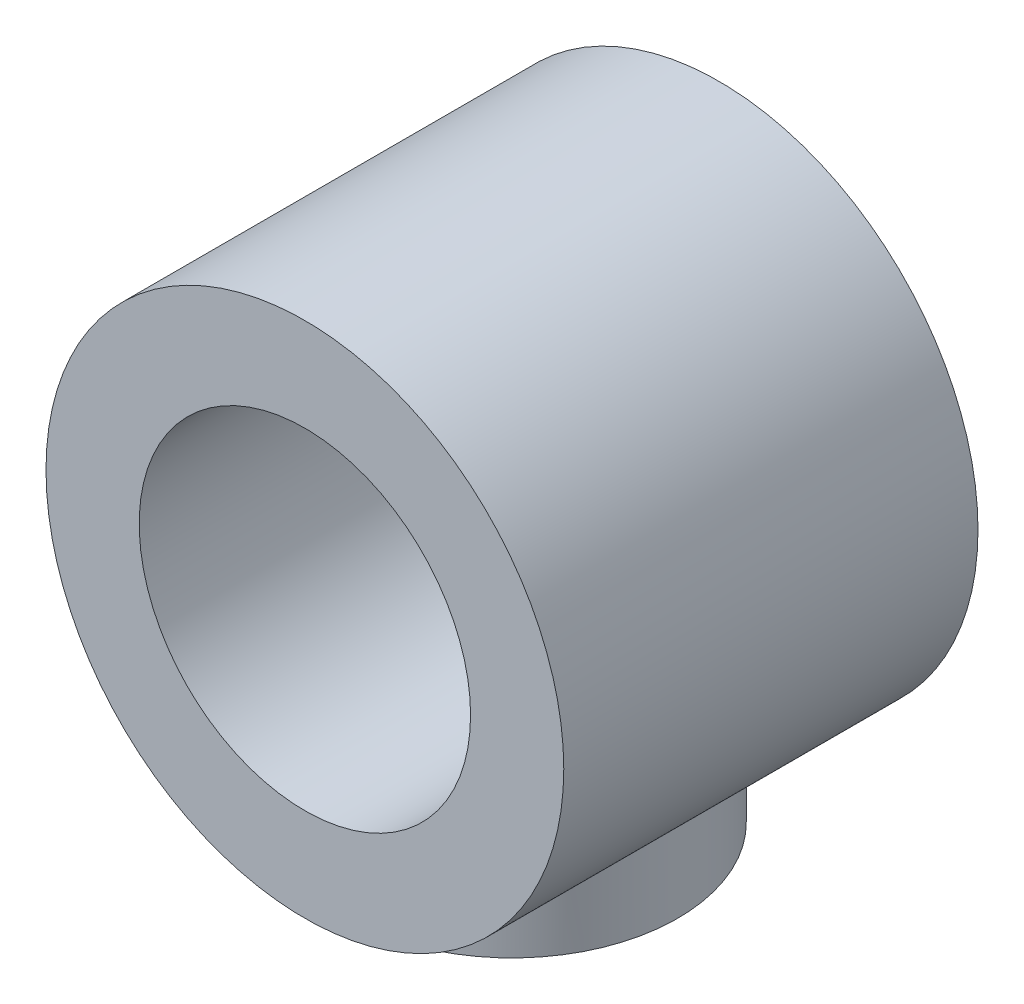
ISO-10303-21;
HEADER;
FILE_DESCRIPTION(('STEP AP214'),'2;1');
FILE_NAME('part.step','',(''),(''),'','','');
FILE_SCHEMA(('AUTOMOTIVE_DESIGN { 1 0 10303 214 1 1 1 1 }'));
ENDSEC;
DATA;
#1=APPLICATION_CONTEXT('core data for automotive mechanical design processes');
#2=APPLICATION_PROTOCOL_DEFINITION('international standard','automotive_design',2000,#1);
#3=PRODUCT_CONTEXT('',#1,'mechanical');
#4=PRODUCT('Part','Part','',(#3));
#5=PRODUCT_RELATED_PRODUCT_CATEGORY('part','',(#4));
#6=PRODUCT_DEFINITION_FORMATION('','',#4);
#7=PRODUCT_DEFINITION_CONTEXT('part definition',#1,'design');
#8=PRODUCT_DEFINITION('design','',#6,#7);
#9=PRODUCT_DEFINITION_SHAPE('','',#8);
#10=(LENGTH_UNIT() NAMED_UNIT(*) SI_UNIT(.MILLI.,.METRE.));
#11=(NAMED_UNIT(*) PLANE_ANGLE_UNIT() SI_UNIT($,.RADIAN.));
#12=(NAMED_UNIT(*) SI_UNIT($,.STERADIAN.) SOLID_ANGLE_UNIT());
#13=UNCERTAINTY_MEASURE_WITH_UNIT(LENGTH_MEASURE(1.E-05),#10,'distance_accuracy_value','');
#14=(GEOMETRIC_REPRESENTATION_CONTEXT(3) GLOBAL_UNCERTAINTY_ASSIGNED_CONTEXT((#13)) GLOBAL_UNIT_ASSIGNED_CONTEXT((#10,
#11,#12)) REPRESENTATION_CONTEXT('',''));
#15=CARTESIAN_POINT('',(0.,0.,0.));
#16=DIRECTION('',(0.,0.,1.));
#17=DIRECTION('',(1.,0.,0.));
#18=AXIS2_PLACEMENT_3D('',#15,#16,#17);
#19=CARTESIAN_POINT('',(0.,-77.5,50.));
#20=DIRECTION('',(0.,1.,0.));
#21=DIRECTION('',(0.,0.,1.));
#22=AXIS2_PLACEMENT_3D('',#19,#20,#21);
#23=CYLINDRICAL_SURFACE('',#22,20.);
#24=CARTESIAN_POINT('',(0.,-72.5,50.));
#25=DIRECTION('',(0.,1.,0.));
#26=DIRECTION('',(0.,0.,1.));
#27=AXIS2_PLACEMENT_3D('',#24,#25,#26);
#28=CIRCLE('',#27,20.);
#29=CARTESIAN_POINT('',(0.,-72.5,70.));
#30=VERTEX_POINT('',#29);
#31=EDGE_CURVE('E19',#30,#30,#28,.T.);
#32=ORIENTED_EDGE('',*,*,#31,.T.);
#33=EDGE_LOOP('',(#32));
#34=FACE_BOUND('',#33,.T.);
#35=CARTESIAN_POINT('',(0.,-67.5,50.));
#36=DIRECTION('',(0.,1.,0.));
#37=DIRECTION('',(0.,0.,1.));
#38=AXIS2_PLACEMENT_3D('',#35,#36,#37);
#39=CIRCLE('',#38,20.);
#40=CARTESIAN_POINT('',(0.,-67.5,70.));
#41=VERTEX_POINT('',#40);
#42=EDGE_CURVE('E71',#41,#41,#39,.F.);
#43=ORIENTED_EDGE('',*,*,#42,.T.);
#44=EDGE_LOOP('',(#43));
#45=FACE_BOUND('',#44,.T.);
#46=ADVANCED_FACE('F14',(#34,#45),#23,.T.);
#47=CARTESIAN_POINT('',(0.,-72.5,50.));
#48=DIRECTION('',(0.,1.,0.));
#49=DIRECTION('',(0.,0.,1.));
#50=AXIS2_PLACEMENT_3D('',#47,#48,#49);
#51=PLANE('',#50);
#52=CARTESIAN_POINT('',(0.,-72.5,50.));
#53=DIRECTION('',(0.,1.,0.));
#54=DIRECTION('',(-1.,0.,0.));
#55=AXIS2_PLACEMENT_3D('',#52,#53,#54);
#56=CIRCLE('',#55,5.053);
#57=CARTESIAN_POINT('',(-5.053,-72.5,50.));
#58=VERTEX_POINT('',#57);
#59=EDGE_CURVE('E69',#58,#58,#56,.T.);
#60=ORIENTED_EDGE('',*,*,#59,.T.);
#61=EDGE_LOOP('',(#60));
#62=FACE_BOUND('',#61,.T.);
#63=ORIENTED_EDGE('',*,*,#31,.F.);
#64=EDGE_LOOP('',(#63));
#65=FACE_BOUND('',#64,.T.);
#66=ADVANCED_FACE('F79',(#62,#65),#51,.F.);
#67=CARTESIAN_POINT('',(0.,-67.5,50.));
#68=DIRECTION('',(0.,1.,0.));
#69=DIRECTION('',(0.,0.,1.));
#70=AXIS2_PLACEMENT_3D('',#67,#68,#69);
#71=PLANE('',#70);
#72=ORIENTED_EDGE('',*,*,#42,.F.);
#73=EDGE_LOOP('',(#72));
#74=FACE_BOUND('',#73,.T.);
#75=CARTESIAN_POINT('',(0.,-67.5,50.));
#76=DIRECTION('',(0.,1.,0.));
#77=DIRECTION('',(0.,0.,1.));
#78=AXIS2_PLACEMENT_3D('',#75,#76,#77);
#79=CIRCLE('',#78,40.);
#80=CARTESIAN_POINT('',(0.,-67.5,90.));
#81=VERTEX_POINT('',#80);
#82=EDGE_CURVE('E66',#81,#81,#79,.T.);
#83=ORIENTED_EDGE('',*,*,#82,.F.);
#84=EDGE_LOOP('',(#83));
#85=FACE_BOUND('',#84,.T.);
#86=ADVANCED_FACE('F81',(#74,#85),#71,.F.);
#87=CARTESIAN_POINT('',(0.,-72.5,50.));
#88=DIRECTION('',(0.,1.,0.));
#89=DIRECTION('',(-1.,0.,0.));
#90=AXIS2_PLACEMENT_3D('',#87,#88,#89);
#91=CYLINDRICAL_SURFACE('',#90,5.053);
#92=ORIENTED_EDGE('',*,*,#59,.F.);
#93=EDGE_LOOP('',(#92));
#94=FACE_BOUND('',#93,.T.);
#95=CARTESIAN_POINT('',(-5.05300000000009,-39.6795563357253,50.));
#96=CARTESIAN_POINT('',(-5.05299925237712,-39.679556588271,50.1412373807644));
#97=CARTESIAN_POINT('',(-5.04707338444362,-39.6803124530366,50.2824970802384));
#98=CARTESIAN_POINT('',(-5.02340684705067,-39.6833154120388,50.5640629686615));
#99=CARTESIAN_POINT('',(-5.00566054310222,-39.6855632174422,50.7043686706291));
#100=CARTESIAN_POINT('',(-4.95844181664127,-39.6914905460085,50.983203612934));
#101=CARTESIAN_POINT('',(-4.92895007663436,-39.6951724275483,51.1217295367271));
#102=CARTESIAN_POINT('',(-4.85844639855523,-39.7038632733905,51.3958300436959));
#103=CARTESIAN_POINT('',(-4.81743010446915,-39.7088727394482,51.5314034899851));
#104=CARTESIAN_POINT('',(-4.72425217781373,-39.7200659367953,51.7983915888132));
#105=CARTESIAN_POINT('',(-4.67210690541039,-39.7262479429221,51.9298120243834));
#106=CARTESIAN_POINT('',(-4.5569924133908,-39.7396172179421,52.1878282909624));
#107=CARTESIAN_POINT('',(-4.49401920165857,-39.7468048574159,52.3144223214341));
#108=CARTESIAN_POINT('',(-4.35776718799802,-39.7619737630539,52.5617558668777));
#109=CARTESIAN_POINT('',(-4.28449657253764,-39.7699543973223,52.6824999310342));
#110=CARTESIAN_POINT('',(-4.12810079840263,-39.7864922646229,52.917450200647));
#111=CARTESIAN_POINT('',(-4.04497199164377,-39.7950497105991,53.0316539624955));
#112=CARTESIAN_POINT('',(-3.86903798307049,-39.812540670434,53.253223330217));
#113=CARTESIAN_POINT('',(-3.77618794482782,-39.8214758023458,53.3605532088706));
#114=CARTESIAN_POINT('',(-3.58176047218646,-39.8394342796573,53.567060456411));
#115=CARTESIAN_POINT('',(-3.48017982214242,-39.8484576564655,53.6662347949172));
#116=CARTESIAN_POINT('',(-3.26905664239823,-39.8663327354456,53.8556694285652));
#117=CARTESIAN_POINT('',(-3.1595162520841,-39.8751844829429,53.9459321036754));
#118=CARTESIAN_POINT('',(-2.9331696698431,-39.8924729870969,54.1169714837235));
#119=CARTESIAN_POINT('',(-2.81636081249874,-39.9009095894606,54.1977446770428));
#120=CARTESIAN_POINT('',(-2.57596637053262,-39.9171510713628,54.3494211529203));
#121=CARTESIAN_POINT('',(-2.45236151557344,-39.9249539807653,54.420294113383));
#122=CARTESIAN_POINT('',(-2.19952328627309,-39.9396812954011,54.5513949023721));
#123=CARTESIAN_POINT('',(-2.07028783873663,-39.9466053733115,54.6116187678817));
#124=CARTESIAN_POINT('',(-1.8071890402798,-39.9593717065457,54.7209269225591));
#125=CARTESIAN_POINT('',(-1.67332761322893,-39.9652144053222,54.770015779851));
#126=CARTESIAN_POINT('',(-1.40187784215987,-39.9756581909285,54.8567358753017));
#127=CARTESIAN_POINT('',(-1.26428813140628,-39.9802588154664,54.894362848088));
#128=CARTESIAN_POINT('',(-0.849010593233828,-39.9919392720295,54.9892035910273));
#129=CARTESIAN_POINT('',(-0.567100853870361,-39.9969833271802,55.0290864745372));
#130=CARTESIAN_POINT('',(-0.000550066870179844,-40.0010027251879,55.0609585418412));
#131=CARTESIAN_POINT('',(0.284090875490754,-39.9999783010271,55.0529495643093));
#132=CARTESIAN_POINT('',(0.705919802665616,-39.9940185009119,55.005442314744));
#133=CARTESIAN_POINT('',(0.845354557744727,-39.991306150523,54.9837825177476));
#134=CARTESIAN_POINT('',(1.12187663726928,-39.9845027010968,54.9288981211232));
#135=CARTESIAN_POINT('',(1.25896481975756,-39.9804121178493,54.8956778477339));
#136=CARTESIAN_POINT('',(1.52988812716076,-39.9709624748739,54.8178969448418));
#137=CARTESIAN_POINT('',(1.66372196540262,-39.9656029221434,54.7733319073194));
#138=CARTESIAN_POINT('',(1.92710882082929,-39.9537685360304,54.6732108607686));
#139=CARTESIAN_POINT('',(2.05666336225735,-39.9472941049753,54.6176588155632));
#140=CARTESIAN_POINT('',(2.31103830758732,-39.9333868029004,54.4957608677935));
#141=CARTESIAN_POINT('',(2.43584256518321,-39.9259509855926,54.4293816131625));
#142=CARTESIAN_POINT('',(2.67937561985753,-39.910347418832,54.2864533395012));
#143=CARTESIAN_POINT('',(2.79810659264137,-39.9021799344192,54.2099079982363));
#144=CARTESIAN_POINT('',(3.02875915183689,-39.8853356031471,54.0471418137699));
#145=CARTESIAN_POINT('',(3.14067852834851,-39.8766585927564,53.9609178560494));
#146=CARTESIAN_POINT('',(3.35685594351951,-39.8590426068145,53.7794491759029));
#147=CARTESIAN_POINT('',(3.46111673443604,-39.8501037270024,53.6842077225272));
#148=CARTESIAN_POINT('',(3.6620220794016,-39.8321458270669,53.4846227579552));
#149=CARTESIAN_POINT('',(3.75860666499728,-39.823126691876,53.3802188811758));
#150=CARTESIAN_POINT('',(3.94260987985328,-39.8053309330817,53.1636713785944));
#151=CARTESIAN_POINT('',(4.03003184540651,-39.7965542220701,53.0515305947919));
#152=CARTESIAN_POINT('',(4.19520212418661,-39.7794819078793,52.8201609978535));
#153=CARTESIAN_POINT('',(4.27294232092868,-39.7711867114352,52.700926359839));
#154=CARTESIAN_POINT('',(4.41808133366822,-39.7553252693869,52.4563349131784));
#155=CARTESIAN_POINT('',(4.48548401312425,-39.7477587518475,52.3309804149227));
#156=CARTESIAN_POINT('',(4.60959789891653,-39.7335565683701,52.0747795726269));
#157=CARTESIAN_POINT('',(4.66629137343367,-39.7269224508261,51.9439245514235));
#158=CARTESIAN_POINT('',(4.76841359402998,-39.7147941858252,51.6778951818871));
#159=CARTESIAN_POINT('',(4.81384664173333,-39.7092996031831,51.5427225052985));
#160=CARTESIAN_POINT('',(4.89307121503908,-39.6996151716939,51.2692130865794));
#161=CARTESIAN_POINT('',(4.92688230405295,-39.6954231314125,51.1308820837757));
#162=CARTESIAN_POINT('',(4.98270326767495,-39.6884550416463,50.8518810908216));
#163=CARTESIAN_POINT('',(5.00471887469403,-39.6856783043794,50.7112122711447));
#164=CARTESIAN_POINT('',(5.03149691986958,-39.6822901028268,50.475302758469));
#165=CARTESIAN_POINT('',(5.03955767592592,-39.681266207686,50.380429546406));
#166=CARTESIAN_POINT('',(5.05030946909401,-39.6798992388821,50.1903742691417));
#167=CARTESIAN_POINT('',(5.05300050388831,-39.6795561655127,50.0951922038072));
#168=CARTESIAN_POINT('',(5.05299925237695,-39.679556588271,49.8587626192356));
#169=CARTESIAN_POINT('',(5.04707338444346,-39.6803124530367,49.7175029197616));
#170=CARTESIAN_POINT('',(5.02340684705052,-39.6833154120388,49.4359370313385));
#171=CARTESIAN_POINT('',(5.00566054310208,-39.6855632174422,49.2956313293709));
#172=CARTESIAN_POINT('',(4.95844181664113,-39.6914905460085,49.016796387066));
#173=CARTESIAN_POINT('',(4.92895007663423,-39.6951724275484,48.8782704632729));
#174=CARTESIAN_POINT('',(4.8584463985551,-39.7038632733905,48.6041699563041));
#175=CARTESIAN_POINT('',(4.81743010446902,-39.7088727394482,48.4685965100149));
#176=CARTESIAN_POINT('',(4.72425217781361,-39.7200659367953,48.2016084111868));
#177=CARTESIAN_POINT('',(4.67210690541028,-39.7262479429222,48.0701879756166));
#178=CARTESIAN_POINT('',(4.5569924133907,-39.7396172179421,47.8121717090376));
#179=CARTESIAN_POINT('',(4.49401920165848,-39.7468048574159,47.6855776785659));
#180=CARTESIAN_POINT('',(4.35776718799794,-39.7619737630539,47.4382441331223));
#181=CARTESIAN_POINT('',(4.28449657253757,-39.7699543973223,47.3175000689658));
#182=CARTESIAN_POINT('',(4.12810079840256,-39.7864922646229,47.0825497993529));
#183=CARTESIAN_POINT('',(4.04497199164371,-39.7950497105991,46.9683460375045));
#184=CARTESIAN_POINT('',(3.86903798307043,-39.812540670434,46.7467766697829));
#185=CARTESIAN_POINT('',(3.77618794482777,-39.8214758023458,46.6394467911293));
#186=CARTESIAN_POINT('',(3.58176047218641,-39.8394342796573,46.432939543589));
#187=CARTESIAN_POINT('',(3.48017982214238,-39.8484576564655,46.3337652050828));
#188=CARTESIAN_POINT('',(3.2690566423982,-39.8663327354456,46.1443305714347));
#189=CARTESIAN_POINT('',(3.15951625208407,-39.8751844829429,46.0540678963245));
#190=CARTESIAN_POINT('',(2.93316966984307,-39.8924729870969,45.8830285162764));
#191=CARTESIAN_POINT('',(2.81636081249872,-39.9009095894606,45.8022553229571));
#192=CARTESIAN_POINT('',(2.57596637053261,-39.9171510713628,45.6505788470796));
#193=CARTESIAN_POINT('',(2.45236151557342,-39.9249539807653,45.5797058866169));
#194=CARTESIAN_POINT('',(2.19952328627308,-39.9396812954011,45.4486050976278));
#195=CARTESIAN_POINT('',(2.07028783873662,-39.9466053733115,45.3883812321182));
#196=CARTESIAN_POINT('',(1.80718904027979,-39.9593717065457,45.2790730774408));
#197=CARTESIAN_POINT('',(1.67332761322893,-39.9652144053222,45.2299842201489));
#198=CARTESIAN_POINT('',(1.40187784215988,-39.9756581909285,45.1432641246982));
#199=CARTESIAN_POINT('',(1.26428813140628,-39.9802588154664,45.1056371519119));
#200=CARTESIAN_POINT('',(0.849010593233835,-39.9919392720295,45.0107964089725));
#201=CARTESIAN_POINT('',(0.56710085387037,-39.9969833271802,44.9709135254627));
#202=CARTESIAN_POINT('',(0.00055006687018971,-40.0010027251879,44.9390414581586));
#203=CARTESIAN_POINT('',(-0.284090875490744,-39.9999783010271,44.9470504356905));
#204=CARTESIAN_POINT('',(-0.705919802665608,-39.9940185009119,44.9945576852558));
#205=CARTESIAN_POINT('',(-0.845354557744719,-39.991306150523,45.0162174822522));
#206=CARTESIAN_POINT('',(-1.12187663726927,-39.9845027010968,45.0711018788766));
#207=CARTESIAN_POINT('',(-1.25896481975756,-39.9804121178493,45.1043221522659));
#208=CARTESIAN_POINT('',(-1.52988812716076,-39.9709624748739,45.182103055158));
#209=CARTESIAN_POINT('',(-1.66372196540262,-39.9656029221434,45.2266680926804));
#210=CARTESIAN_POINT('',(-1.92710882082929,-39.9537685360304,45.3267891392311));
#211=CARTESIAN_POINT('',(-2.05666336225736,-39.9472941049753,45.3823411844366));
#212=CARTESIAN_POINT('',(-2.31103830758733,-39.9333868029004,45.5042391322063));
#213=CARTESIAN_POINT('',(-2.43584256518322,-39.9259509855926,45.5706183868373));
#214=CARTESIAN_POINT('',(-2.67937561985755,-39.910347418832,45.7135466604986));
#215=CARTESIAN_POINT('',(-2.79810659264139,-39.9021799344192,45.7900920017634));
#216=CARTESIAN_POINT('',(-3.02875915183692,-39.8853356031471,45.9528581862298));
#217=CARTESIAN_POINT('',(-3.14067852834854,-39.8766585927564,46.0390821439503));
#218=CARTESIAN_POINT('',(-3.35685594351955,-39.8590426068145,46.2205508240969));
#219=CARTESIAN_POINT('',(-3.46111673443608,-39.8501037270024,46.3157922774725));
#220=CARTESIAN_POINT('',(-3.66202207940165,-39.8321458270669,46.5153772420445));
#221=CARTESIAN_POINT('',(-3.75860666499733,-39.8231266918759,46.6197811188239));
#222=CARTESIAN_POINT('',(-3.94260987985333,-39.8053309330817,46.8363286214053));
#223=CARTESIAN_POINT('',(-4.03003184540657,-39.7965542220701,46.9484694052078));
#224=CARTESIAN_POINT('',(-4.19520212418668,-39.7794819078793,47.1798390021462));
#225=CARTESIAN_POINT('',(-4.27294232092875,-39.7711867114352,47.2990736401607));
#226=CARTESIAN_POINT('',(-4.4180813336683,-39.7553252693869,47.5436650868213));
#227=CARTESIAN_POINT('',(-4.48548401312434,-39.7477587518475,47.669019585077));
#228=CARTESIAN_POINT('',(-4.60959789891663,-39.7335565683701,47.9252204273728));
#229=CARTESIAN_POINT('',(-4.66629137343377,-39.7269224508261,48.0560754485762));
#230=CARTESIAN_POINT('',(-4.76841359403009,-39.7147941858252,48.3221048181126));
#231=CARTESIAN_POINT('',(-4.81384664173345,-39.7092996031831,48.4572774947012));
#232=CARTESIAN_POINT('',(-4.89307121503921,-39.6996151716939,48.7307869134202));
#233=CARTESIAN_POINT('',(-4.92688230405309,-39.6954231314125,48.869117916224));
#234=CARTESIAN_POINT('',(-4.9827032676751,-39.6884550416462,49.1481189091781));
#235=CARTESIAN_POINT('',(-5.00471887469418,-39.6856783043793,49.2887877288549));
#236=CARTESIAN_POINT('',(-5.03149691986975,-39.6822901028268,49.5246972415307));
#237=CARTESIAN_POINT('',(-5.03955767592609,-39.681266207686,49.6195704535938));
#238=CARTESIAN_POINT('',(-5.05030946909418,-39.6798992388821,49.8096257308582));
#239=CARTESIAN_POINT('',(-5.05300050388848,-39.6795561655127,49.9048077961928));
#240=CARTESIAN_POINT('',(-5.05300000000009,-39.6795563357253,50.));
#241=B_SPLINE_CURVE_WITH_KNOTS('',3,(#95,#96,#97,#98,#99,#100,#101,#102,#103,#104,#105,#106,
#107,#108,#109,#110,#111,#112,#113,#114,#115,#116,#117,#118,#119,#120,#121,#122,#123,#124,#125,
#126,#127,#128,#129,#130,#131,#132,#133,#134,#135,#136,#137,#138,#139,#140,#141,#142,#143,#144,
#145,#146,#147,#148,#149,#150,#151,#152,#153,#154,#155,#156,#157,#158,#159,#160,#161,#162,#163,
#164,#165,#166,#167,#168,#169,#170,#171,#172,#173,#174,#175,#176,#177,#178,#179,#180,#181,#182,
#183,#184,#185,#186,#187,#188,#189,#190,#191,#192,#193,#194,#195,#196,#197,#198,#199,#200,#201,
#202,#203,#204,#205,#206,#207,#208,#209,#210,#211,#212,#213,#214,#215,#216,#217,#218,#219,#220,
#221,#222,#223,#224,#225,#226,#227,#228,#229,#230,#231,#232,#233,#234,#235,#236,#237,#238,#239,
#240),.UNSPECIFIED.,.T.,.F.,(4,2,2,2,2,2,2,2,2,2,2,2,2,2,2,2,2,2,2,2,2,2,2,2,2,2,2,2,2,2,2,2,2,
2,2,2,2,2,2,2,2,2,2,2,2,2,2,2,2,2,2,2,2,2,2,2,2,2,2,2,2,2,2,2,2,2,2,2,2,2,2,2,4),(0.,
0.423624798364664,0.847451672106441,1.27197850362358,1.69666601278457,2.12073345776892,
2.54495758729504,2.96884634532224,3.39289245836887,3.81898856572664,4.24524229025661,
4.67138186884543,5.09767864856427,5.52525371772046,5.95298757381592,6.38054563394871,
6.80826260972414,7.65819899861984,8.50810275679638,8.93108491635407,9.35390895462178,
9.77689753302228,10.1997337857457,10.6238980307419,11.0479092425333,11.4720572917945,
11.896052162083,12.3230870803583,12.7499659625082,13.1772003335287,13.604274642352,
14.032049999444,14.4596616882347,14.8865500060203,15.3132306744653,15.598748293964,
15.8842660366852,16.3078908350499,16.7317177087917,17.1562445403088,17.5809320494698,
18.0049994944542,18.4292236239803,18.8531123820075,19.2771584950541,19.7032546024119,
20.1295083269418,20.5556479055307,20.9819446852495,21.4095197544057,21.8372536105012,
22.264811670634,22.6925286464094,23.5424650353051,24.3923687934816,24.8153509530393,
25.238174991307,25.6611635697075,26.083999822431,26.5081640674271,26.9321752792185,
27.3563233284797,27.7803181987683,28.2073531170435,28.6342319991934,29.061466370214,
29.4885406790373,29.9163160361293,30.3439277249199,30.7708160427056,31.1974967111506,
31.4830143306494,31.7685320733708),.UNSPECIFIED.);
#242=CARTESIAN_POINT('',(-5.05300000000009,-39.6795563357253,50.));
#243=VERTEX_POINT('',#242);
#244=EDGE_CURVE('E61',#243,#243,#241,.T.);
#245=ORIENTED_EDGE('',*,*,#244,.T.);
#246=EDGE_LOOP('',(#245));
#247=FACE_BOUND('',#246,.T.);
#248=ADVANCED_FACE('F16',(#94,#247),#91,.F.);
#249=CARTESIAN_POINT('',(0.,-62.5,50.));
#250=DIRECTION('',(0.,1.,0.));
#251=DIRECTION('',(0.,0.,1.));
#252=AXIS2_PLACEMENT_3D('',#249,#250,#251);
#253=CYLINDRICAL_SURFACE('',#252,40.);
#254=ORIENTED_EDGE('',*,*,#82,.T.);
#255=EDGE_LOOP('',(#254));
#256=FACE_BOUND('',#255,.T.);
#257=CARTESIAN_POINT('',(40.,-48.0234317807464,50.));
#258=CARTESIAN_POINT('',(40.000002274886,-48.0234282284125,49.0110663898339));
#259=CARTESIAN_POINT('',(39.9632625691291,-48.054102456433,48.0221581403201));
#260=CARTESIAN_POINT('',(39.8170734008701,-48.175300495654,46.053485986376));
#261=CARTESIAN_POINT('',(39.7076243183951,-48.2658239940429,45.0737220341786));
#262=CARTESIAN_POINT('',(39.4179530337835,-48.5026781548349,43.1303883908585));
#263=CARTESIAN_POINT('',(39.2376408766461,-48.6490797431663,42.1668409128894));
#264=CARTESIAN_POINT('',(38.8092979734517,-48.9914617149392,40.2640004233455));
#265=CARTESIAN_POINT('',(38.5612639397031,-49.1874445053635,39.3247085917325));
#266=CARTESIAN_POINT('',(38.0034485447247,-49.6196646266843,37.4838087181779));
#267=CARTESIAN_POINT('',(37.6942300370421,-49.8555323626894,36.5819417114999));
#268=CARTESIAN_POINT('',(37.0159833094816,-50.36115298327,34.8106462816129));
#269=CARTESIAN_POINT('',(36.6469460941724,-50.6309109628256,33.9412227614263));
#270=CARTESIAN_POINT('',(36.0509619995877,-51.0552412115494,32.6636476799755));
#271=CARTESIAN_POINT('',(35.845198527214,-51.1999877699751,32.2421607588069));
#272=CARTESIAN_POINT('',(35.4199031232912,-51.4951206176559,31.4083511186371));
#273=CARTESIAN_POINT('',(35.2003747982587,-51.6455054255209,30.9960260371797));
#274=CARTESIAN_POINT('',(34.5214873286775,-52.1038867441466,29.7728708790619));
#275=CARTESIAN_POINT('',(34.0418418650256,-52.4190985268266,28.9758954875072));
#276=CARTESIAN_POINT('',(32.9593070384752,-53.1074536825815,27.3106817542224));
#277=CARTESIAN_POINT('',(32.3485828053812,-53.4824817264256,26.4483238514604));
#278=CARTESIAN_POINT('',(31.0625530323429,-54.239511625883,24.7763970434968));
#279=CARTESIAN_POINT('',(30.3872433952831,-54.6215139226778,23.9668314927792));
#280=CARTESIAN_POINT('',(28.9738574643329,-55.384211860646,22.402396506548));
#281=CARTESIAN_POINT('',(28.2357290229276,-55.7649061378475,21.6475734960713));
#282=CARTESIAN_POINT('',(26.6994212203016,-56.5165672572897,20.1963497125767));
#283=CARTESIAN_POINT('',(25.9012381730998,-56.8875335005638,19.4999525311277));
#284=CARTESIAN_POINT('',(24.1403377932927,-57.6587635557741,18.0832276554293));
#285=CARTESIAN_POINT('',(23.1696814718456,-58.0566281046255,17.3714143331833));
#286=CARTESIAN_POINT('',(21.1588424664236,-58.8192974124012,16.032925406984));
#287=CARTESIAN_POINT('',(20.118652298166,-59.1840986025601,15.4062589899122));
#288=CARTESIAN_POINT('',(17.9750686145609,-59.8699581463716,14.2455468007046));
#289=CARTESIAN_POINT('',(16.8717254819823,-60.1910506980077,13.71142852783));
#290=CARTESIAN_POINT('',(14.6086179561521,-60.7799705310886,12.7427491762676));
#291=CARTESIAN_POINT('',(13.4488645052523,-61.0478080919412,12.3081688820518));
#292=CARTESIAN_POINT('',(11.2070110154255,-61.4964863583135,11.5859502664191));
#293=CARTESIAN_POINT('',(10.1296069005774,-61.6835204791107,11.2876531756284));
#294=CARTESIAN_POINT('',(8.49210050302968,-61.9228496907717,10.9078171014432));
#295=CARTESIAN_POINT('',(7.94261475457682,-61.9957635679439,10.7924611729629));
#296=CARTESIAN_POINT('',(6.83764612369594,-62.1273361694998,10.5847438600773));
#297=CARTESIAN_POINT('',(6.28216400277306,-62.1859966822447,10.4923795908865));
#298=CARTESIAN_POINT('',(5.16691325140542,-62.2885735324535,10.331117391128));
#299=CARTESIAN_POINT('',(4.60714838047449,-62.3325015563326,10.2622008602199));
#300=CARTESIAN_POINT('',(3.48430701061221,-62.4053369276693,10.1480488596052));
#301=CARTESIAN_POINT('',(2.92123095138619,-62.434246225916,10.1028103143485));
#302=CARTESIAN_POINT('',(1.79310228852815,-62.4768223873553,10.0362163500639));
#303=CARTESIAN_POINT('',(1.22804975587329,-62.4904897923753,10.0148600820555));
#304=CARTESIAN_POINT('',(0.0974431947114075,-62.502482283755,9.9961214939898));
#305=CARTESIAN_POINT('',(-0.468110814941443,-62.5008079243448,9.99873830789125));
#306=CARTESIAN_POINT('',(-2.00434143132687,-62.4753933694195,10.0384502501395));
#307=CARTESIAN_POINT('',(-2.97430724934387,-62.4366715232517,10.0989542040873));
#308=CARTESIAN_POINT('',(-4.90424555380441,-62.3147950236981,10.289938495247));
#309=CARTESIAN_POINT('',(-5.86421920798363,-62.2316456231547,10.4204105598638));
#310=CARTESIAN_POINT('',(-7.76772486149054,-62.0228114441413,10.7495818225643));
#311=CARTESIAN_POINT('',(-8.71125618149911,-61.8971249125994,10.9482838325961));
#312=CARTESIAN_POINT('',(-10.5757408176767,-61.6059590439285,11.4114447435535));
#313=CARTESIAN_POINT('',(-11.4966931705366,-61.4404780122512,11.6759064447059));
#314=CARTESIAN_POINT('',(-13.3109411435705,-61.0731182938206,12.2676587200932));
#315=CARTESIAN_POINT('',(-14.204229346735,-60.8712299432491,12.5949659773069));
#316=CARTESIAN_POINT('',(-15.9584402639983,-60.4350492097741,13.3090600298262));
#317=CARTESIAN_POINT('',(-16.8193634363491,-60.2007572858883,13.695845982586));
#318=CARTESIAN_POINT('',(-18.5053296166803,-59.7040635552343,14.5255634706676));
#319=CARTESIAN_POINT('',(-19.3303693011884,-59.4416591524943,14.9685001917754));
#320=CARTESIAN_POINT('',(-20.9416281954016,-58.8933154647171,15.9072188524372));
#321=CARTESIAN_POINT('',(-21.7278448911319,-58.607374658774,16.4030042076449));
#322=CARTESIAN_POINT('',(-23.3565708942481,-57.9791010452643,17.5106180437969));
#323=CARTESIAN_POINT('',(-24.1935197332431,-57.634221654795,18.1291854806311));
#324=CARTESIAN_POINT('',(-25.8124955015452,-56.9275452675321,19.4256510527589));
#325=CARTESIAN_POINT('',(-26.5945185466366,-56.5657470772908,20.1035533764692));
#326=CARTESIAN_POINT('',(-28.1023881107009,-55.8319771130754,21.516241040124));
#327=CARTESIAN_POINT('',(-28.8281594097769,-55.4599925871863,22.2511000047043));
#328=CARTESIAN_POINT('',(-30.2202956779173,-54.7138697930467,23.7740915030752));
#329=CARTESIAN_POINT('',(-30.8866572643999,-54.3397314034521,24.5622270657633));
#330=CARTESIAN_POINT('',(-32.2463944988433,-53.5455235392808,26.3028719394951));
#331=CARTESIAN_POINT('',(-32.9305875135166,-53.1263214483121,27.2629798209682));
#332=CARTESIAN_POINT('',(-34.2151636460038,-52.3082464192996,29.2462383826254));
#333=CARTESIAN_POINT('',(-34.8155325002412,-51.9093769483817,30.2693997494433));
#334=CARTESIAN_POINT('',(-35.9269866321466,-51.1464137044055,32.3742622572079));
#335=CARTESIAN_POINT('',(-36.4381572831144,-50.7822868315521,33.4559061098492));
#336=CARTESIAN_POINT('',(-37.3658659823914,-50.1036197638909,35.6739440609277));
#337=CARTESIAN_POINT('',(-37.7824338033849,-49.7890639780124,36.8103207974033));
#338=CARTESIAN_POINT('',(-38.4497779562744,-49.2748368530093,38.9266271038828));
#339=CARTESIAN_POINT('',(-38.7168304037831,-49.0646894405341,39.8988856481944));
#340=CARTESIAN_POINT('',(-39.1782158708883,-48.6970708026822,41.8703226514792));
#341=CARTESIAN_POINT('',(-39.3725591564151,-48.5395921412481,42.8694972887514));
#342=CARTESIAN_POINT('',(-39.684758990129,-48.2846839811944,44.8854852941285));
#343=CARTESIAN_POINT('',(-39.8027552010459,-48.1871448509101,45.9022629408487));
#344=CARTESIAN_POINT('',(-39.9603727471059,-48.0565220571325,47.9460364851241));
#345=CARTESIAN_POINT('',(-39.9999976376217,-48.0234354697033,48.9730319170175));
#346=CARTESIAN_POINT('',(-40.000002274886,-48.0234282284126,50.9889336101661));
#347=CARTESIAN_POINT('',(-39.9632625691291,-48.054102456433,51.9778418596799));
#348=CARTESIAN_POINT('',(-39.81707340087,-48.175300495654,53.9465140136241));
#349=CARTESIAN_POINT('',(-39.7076243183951,-48.2658239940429,54.9262779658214));
#350=CARTESIAN_POINT('',(-39.4179530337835,-48.5026781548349,56.8696116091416));
#351=CARTESIAN_POINT('',(-39.2376408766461,-48.6490797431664,57.8331590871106));
#352=CARTESIAN_POINT('',(-38.8092979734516,-48.9914617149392,59.7359995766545));
#353=CARTESIAN_POINT('',(-38.5612639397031,-49.1874445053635,60.6752914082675));
#354=CARTESIAN_POINT('',(-38.0034485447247,-49.6196646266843,62.5161912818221));
#355=CARTESIAN_POINT('',(-37.6942300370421,-49.8555323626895,63.4180582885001));
#356=CARTESIAN_POINT('',(-37.0159833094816,-50.36115298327,65.1893537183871));
#357=CARTESIAN_POINT('',(-36.6469460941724,-50.6309109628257,66.0587772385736));
#358=CARTESIAN_POINT('',(-36.0509619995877,-51.0552412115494,67.3363523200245));
#359=CARTESIAN_POINT('',(-35.845198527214,-51.1999877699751,67.7578392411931));
#360=CARTESIAN_POINT('',(-35.4199031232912,-51.4951206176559,68.5916488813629));
#361=CARTESIAN_POINT('',(-35.2003747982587,-51.6455054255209,69.0039739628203));
#362=CARTESIAN_POINT('',(-34.5214873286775,-52.1038867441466,70.2271291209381));
#363=CARTESIAN_POINT('',(-34.0418418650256,-52.4190985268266,71.0241045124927));
#364=CARTESIAN_POINT('',(-32.9593070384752,-53.1074536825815,72.6893182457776));
#365=CARTESIAN_POINT('',(-32.3485828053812,-53.4824817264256,73.5516761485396));
#366=CARTESIAN_POINT('',(-31.0625530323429,-54.239511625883,75.2236029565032));
#367=CARTESIAN_POINT('',(-30.3872433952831,-54.6215139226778,76.0331685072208));
#368=CARTESIAN_POINT('',(-28.9738574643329,-55.384211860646,77.597603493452));
#369=CARTESIAN_POINT('',(-28.2357290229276,-55.7649061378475,78.3524265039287));
#370=CARTESIAN_POINT('',(-26.6994212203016,-56.5165672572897,79.8036502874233));
#371=CARTESIAN_POINT('',(-25.9012381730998,-56.8875335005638,80.5000474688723));
#372=CARTESIAN_POINT('',(-24.1403377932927,-57.6587635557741,81.9167723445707));
#373=CARTESIAN_POINT('',(-23.1696814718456,-58.0566281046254,82.6285856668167));
#374=CARTESIAN_POINT('',(-21.1588424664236,-58.8192974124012,83.967074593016));
#375=CARTESIAN_POINT('',(-20.118652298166,-59.1840986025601,84.5937410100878));
#376=CARTESIAN_POINT('',(-17.9750686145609,-59.8699581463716,85.7544531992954));
#377=CARTESIAN_POINT('',(-16.8717254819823,-60.1910506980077,86.28857147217));
#378=CARTESIAN_POINT('',(-14.6086179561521,-60.7799705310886,87.2572508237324));
#379=CARTESIAN_POINT('',(-13.4488645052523,-61.0478080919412,87.6918311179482));
#380=CARTESIAN_POINT('',(-11.2070110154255,-61.4964863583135,88.4140497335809));
#381=CARTESIAN_POINT('',(-10.1296069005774,-61.6835204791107,88.7123468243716));
#382=CARTESIAN_POINT('',(-8.49210050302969,-61.9228496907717,89.0921828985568));
#383=CARTESIAN_POINT('',(-7.94261475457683,-61.9957635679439,89.2075388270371));
#384=CARTESIAN_POINT('',(-6.83764612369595,-62.1273361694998,89.4152561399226));
#385=CARTESIAN_POINT('',(-6.28216400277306,-62.1859966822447,89.5076204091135));
#386=CARTESIAN_POINT('',(-5.16691325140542,-62.2885735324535,89.668882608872));
#387=CARTESIAN_POINT('',(-4.60714838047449,-62.3325015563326,89.7377991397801));
#388=CARTESIAN_POINT('',(-3.48430701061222,-62.4053369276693,89.8519511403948));
#389=CARTESIAN_POINT('',(-2.92123095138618,-62.434246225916,89.8971896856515));
#390=CARTESIAN_POINT('',(-1.79310228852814,-62.4768223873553,89.9637836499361));
#391=CARTESIAN_POINT('',(-1.22804975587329,-62.4904897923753,89.9851399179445));
#392=CARTESIAN_POINT('',(-0.0974431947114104,-62.502482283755,90.0038785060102));
#393=CARTESIAN_POINT('',(0.468110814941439,-62.5008079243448,90.0012616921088));
#394=CARTESIAN_POINT('',(2.00434143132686,-62.4753933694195,89.9615497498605));
#395=CARTESIAN_POINT('',(2.97430724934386,-62.4366715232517,89.9010457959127));
#396=CARTESIAN_POINT('',(4.90424555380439,-62.3147950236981,89.710061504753));
#397=CARTESIAN_POINT('',(5.86421920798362,-62.2316456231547,89.5795894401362));
#398=CARTESIAN_POINT('',(7.76772486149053,-62.0228114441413,89.2504181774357));
#399=CARTESIAN_POINT('',(8.7112561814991,-61.8971249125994,89.0517161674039));
#400=CARTESIAN_POINT('',(10.5757408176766,-61.6059590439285,88.5885552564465));
#401=CARTESIAN_POINT('',(11.4966931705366,-61.4404780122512,88.3240935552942));
#402=CARTESIAN_POINT('',(13.3109411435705,-61.0731182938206,87.7323412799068));
#403=CARTESIAN_POINT('',(14.204229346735,-60.8712299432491,87.4050340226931));
#404=CARTESIAN_POINT('',(15.9584402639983,-60.4350492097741,86.6909399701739));
#405=CARTESIAN_POINT('',(16.8193634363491,-60.2007572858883,86.304154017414));
#406=CARTESIAN_POINT('',(18.5053296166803,-59.7040635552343,85.4744365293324));
#407=CARTESIAN_POINT('',(19.3303693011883,-59.4416591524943,85.0314998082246));
#408=CARTESIAN_POINT('',(20.9416281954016,-58.8933154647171,84.0927811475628));
#409=CARTESIAN_POINT('',(21.7278448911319,-58.607374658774,83.5969957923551));
#410=CARTESIAN_POINT('',(23.3565708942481,-57.9791010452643,82.4893819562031));
#411=CARTESIAN_POINT('',(24.1935197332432,-57.634221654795,81.8708145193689));
#412=CARTESIAN_POINT('',(25.8124955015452,-56.927545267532,80.5743489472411));
#413=CARTESIAN_POINT('',(26.5945185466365,-56.5657470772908,79.8964466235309));
#414=CARTESIAN_POINT('',(28.1023881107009,-55.8319771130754,78.4837589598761));
#415=CARTESIAN_POINT('',(28.8281594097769,-55.4599925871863,77.7488999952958));
#416=CARTESIAN_POINT('',(30.2202956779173,-54.7138697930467,76.2259084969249));
#417=CARTESIAN_POINT('',(30.8866572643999,-54.3397314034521,75.4377729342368));
#418=CARTESIAN_POINT('',(32.2463944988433,-53.5455235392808,73.697128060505));
#419=CARTESIAN_POINT('',(32.9305875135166,-53.1263214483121,72.7370201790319));
#420=CARTESIAN_POINT('',(34.2151636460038,-52.3082464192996,70.7537616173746));
#421=CARTESIAN_POINT('',(34.8155325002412,-51.9093769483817,69.7306002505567));
#422=CARTESIAN_POINT('',(35.9269866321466,-51.1464137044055,67.6257377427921));
#423=CARTESIAN_POINT('',(36.4381572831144,-50.7822868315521,66.5440938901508));
#424=CARTESIAN_POINT('',(37.3658659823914,-50.1036197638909,64.3260559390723));
#425=CARTESIAN_POINT('',(37.7824338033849,-49.7890639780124,63.1896792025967));
#426=CARTESIAN_POINT('',(38.4497779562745,-49.2748368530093,61.0733728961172));
#427=CARTESIAN_POINT('',(38.7168304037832,-49.0646894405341,60.1011143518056));
#428=CARTESIAN_POINT('',(39.1782158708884,-48.6970708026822,58.1296773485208));
#429=CARTESIAN_POINT('',(39.3725591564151,-48.5395921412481,57.1305027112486));
#430=CARTESIAN_POINT('',(39.684758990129,-48.2846839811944,55.1145147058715));
#431=CARTESIAN_POINT('',(39.8027552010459,-48.1871448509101,54.0977370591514));
#432=CARTESIAN_POINT('',(39.9603727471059,-48.0565220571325,52.053963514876));
#433=CARTESIAN_POINT('',(39.9999976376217,-48.0234354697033,51.0269680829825));
#434=CARTESIAN_POINT('',(40.,-48.0234317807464,50.));
#435=B_SPLINE_CURVE_WITH_KNOTS('',3,(#257,#258,#259,#260,#261,#262,#263,#264,#265,#266,#267,
#268,#269,#270,#271,#272,#273,#274,#275,#276,#277,#278,#279,#280,#281,#282,#283,#284,#285,#286,
#287,#288,#289,#290,#291,#292,#293,#294,#295,#296,#297,#298,#299,#300,#301,#302,#303,#304,#305,
#306,#307,#308,#309,#310,#311,#312,#313,#314,#315,#316,#317,#318,#319,#320,#321,#322,#323,#324,
#325,#326,#327,#328,#329,#330,#331,#332,#333,#334,#335,#336,#337,#338,#339,#340,#341,#342,#343,
#344,#345,#346,#347,#348,#349,#350,#351,#352,#353,#354,#355,#356,#357,#358,#359,#360,#361,#362,
#363,#364,#365,#366,#367,#368,#369,#370,#371,#372,#373,#374,#375,#376,#377,#378,#379,#380,#381,
#382,#383,#384,#385,#386,#387,#388,#389,#390,#391,#392,#393,#394,#395,#396,#397,#398,#399,#400,
#401,#402,#403,#404,#405,#406,#407,#408,#409,#410,#411,#412,#413,#414,#415,#416,#417,#418,#419,
#420,#421,#422,#423,#424,#425,#426,#427,#428,#429,#430,#431,#432,#433,#434),.UNSPECIFIED.,.T.,
.F.,(4,2,2,2,2,2,2,2,2,2,2,2,2,2,2,2,2,2,2,2,2,2,2,2,2,2,2,2,2,2,2,2,2,2,2,2,2,2,2,2,2,2,2,2,2,
2,2,2,2,2,2,2,2,2,2,2,2,2,2,2,2,2,2,2,2,2,2,2,2,2,2,2,2,2,2,2,2,2,2,2,2,2,2,2,2,2,2,2,4),(0.,
2.96562078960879,5.93122607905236,8.90060819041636,11.870134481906,14.8135168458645,
17.7573422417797,19.2296536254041,20.7015808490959,23.6455547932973,27.0062327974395,
30.3671241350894,33.730833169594,37.0947488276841,40.8928830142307,44.6914266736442,
48.4869810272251,52.2818020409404,55.6767238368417,57.3746914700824,59.0724459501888,
60.7688504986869,62.4650346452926,64.1611584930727,65.8572210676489,68.7711905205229,
71.6848155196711,74.5985606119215,77.5124298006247,80.4270735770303,83.3416760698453,
86.2565479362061,89.1716083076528,92.4574649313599,95.7435536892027,99.0339633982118,
102.32456033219,106.073854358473,109.823785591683,113.570107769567,117.315249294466,
120.401164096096,123.486643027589,126.566461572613,129.646140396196,132.611761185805,
135.577366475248,138.546748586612,141.516274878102,144.45965724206,147.403482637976,
148.8757940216,150.347721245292,153.291695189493,156.652373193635,160.013264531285,
163.37697356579,166.74088922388,170.539023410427,174.33756706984,178.133121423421,
181.927942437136,185.322864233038,187.020831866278,188.718586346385,190.414990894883,
192.111175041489,193.807298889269,195.503361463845,198.417330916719,201.330955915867,
204.244701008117,207.158570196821,210.073213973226,212.987816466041,215.902688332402,
218.817748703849,222.103605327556,225.389694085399,228.680103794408,231.970700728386,
235.719994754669,239.469925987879,243.216248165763,246.961389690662,250.047304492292,
253.132783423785,256.212601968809,259.292280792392),.UNSPECIFIED.);
#436=CARTESIAN_POINT('',(40.,-48.0234317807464,50.));
#437=VERTEX_POINT('',#436);
#438=EDGE_CURVE('E33',#437,#437,#435,.T.);
#439=ORIENTED_EDGE('',*,*,#438,.F.);
#440=EDGE_LOOP('',(#439));
#441=FACE_BOUND('',#440,.T.);
#442=ADVANCED_FACE('F41',(#256,#441),#253,.T.);
#443=CARTESIAN_POINT('',(0.,0.,0.));
#444=DIRECTION('',(0.,0.,1.));
#445=DIRECTION('',(1.,0.,0.));
#446=AXIS2_PLACEMENT_3D('',#443,#444,#445);
#447=CYLINDRICAL_SURFACE('',#446,40.);
#448=CARTESIAN_POINT('',(0.,0.,100.));
#449=DIRECTION('',(0.,0.,1.));
#450=DIRECTION('',(1.,0.,0.));
#451=AXIS2_PLACEMENT_3D('',#448,#449,#450);
#452=CIRCLE('',#451,40.);
#453=CARTESIAN_POINT('',(40.,0.,100.));
#454=VERTEX_POINT('',#453);
#455=EDGE_CURVE('E39',#454,#454,#452,.T.);
#456=ORIENTED_EDGE('',*,*,#455,.T.);
#457=EDGE_LOOP('',(#456));
#458=FACE_BOUND('',#457,.T.);
#459=ORIENTED_EDGE('',*,*,#244,.F.);
#460=EDGE_LOOP('',(#459));
#461=FACE_BOUND('',#460,.T.);
#462=CARTESIAN_POINT('',(0.,0.,0.));
#463=DIRECTION('',(0.,0.,1.));
#464=DIRECTION('',(1.,0.,0.));
#465=AXIS2_PLACEMENT_3D('',#462,#463,#464);
#466=CIRCLE('',#465,40.);
#467=CARTESIAN_POINT('',(40.,0.,0.));
#468=VERTEX_POINT('',#467);
#469=EDGE_CURVE('E28',#468,#468,#466,.T.);
#470=ORIENTED_EDGE('',*,*,#469,.F.);
#471=EDGE_LOOP('',(#470));
#472=FACE_BOUND('',#471,.T.);
#473=ADVANCED_FACE('F56',(#458,#461,#472),#447,.F.);
#474=CARTESIAN_POINT('',(0.,0.,100.));
#475=DIRECTION('',(0.,0.,-1.));
#476=DIRECTION('',(-1.,0.,0.));
#477=AXIS2_PLACEMENT_3D('',#474,#475,#476);
#478=PLANE('',#477);
#479=ORIENTED_EDGE('',*,*,#455,.F.);
#480=EDGE_LOOP('',(#479));
#481=FACE_BOUND('',#480,.T.);
#482=CARTESIAN_POINT('',(0.,0.,100.));
#483=DIRECTION('',(0.,0.,1.));
#484=DIRECTION('',(1.,0.,0.));
#485=AXIS2_PLACEMENT_3D('',#482,#483,#484);
#486=CIRCLE('',#485,62.5);
#487=CARTESIAN_POINT('',(62.5,0.,100.));
#488=VERTEX_POINT('',#487);
#489=EDGE_CURVE('E23',#488,#488,#486,.F.);
#490=ORIENTED_EDGE('',*,*,#489,.F.);
#491=EDGE_LOOP('',(#490));
#492=FACE_BOUND('',#491,.T.);
#493=ADVANCED_FACE('F53',(#481,#492),#478,.F.);
#494=CARTESIAN_POINT('',(0.,0.,0.));
#495=DIRECTION('',(0.,0.,-1.));
#496=DIRECTION('',(-1.,0.,0.));
#497=AXIS2_PLACEMENT_3D('',#494,#495,#496);
#498=PLANE('',#497);
#499=ORIENTED_EDGE('',*,*,#469,.T.);
#500=EDGE_LOOP('',(#499));
#501=FACE_BOUND('',#500,.T.);
#502=CARTESIAN_POINT('',(0.,0.,0.));
#503=DIRECTION('',(0.,0.,1.));
#504=DIRECTION('',(1.,0.,0.));
#505=AXIS2_PLACEMENT_3D('',#502,#503,#504);
#506=CIRCLE('',#505,62.5);
#507=CARTESIAN_POINT('',(62.5,0.,0.));
#508=VERTEX_POINT('',#507);
#509=EDGE_CURVE('E9',#508,#508,#506,.T.);
#510=ORIENTED_EDGE('',*,*,#509,.F.);
#511=EDGE_LOOP('',(#510));
#512=FACE_BOUND('',#511,.T.);
#513=ADVANCED_FACE('F49',(#501,#512),#498,.T.);
#514=CARTESIAN_POINT('',(0.,0.,0.));
#515=DIRECTION('',(0.,0.,1.));
#516=DIRECTION('',(1.,0.,0.));
#517=AXIS2_PLACEMENT_3D('',#514,#515,#516);
#518=CYLINDRICAL_SURFACE('',#517,62.5);
#519=ORIENTED_EDGE('',*,*,#489,.T.);
#520=EDGE_LOOP('',(#519));
#521=FACE_BOUND('',#520,.T.);
#522=ORIENTED_EDGE('',*,*,#509,.T.);
#523=EDGE_LOOP('',(#522));
#524=FACE_BOUND('',#523,.T.);
#525=ORIENTED_EDGE('',*,*,#438,.T.);
#526=EDGE_LOOP('',(#525));
#527=FACE_BOUND('',#526,.T.);
#528=ADVANCED_FACE('F45',(#521,#524,#527),#518,.T.);
#529=CLOSED_SHELL('',(#46,#66,#86,#248,#442,#473,#493,#513,#528));
#530=MANIFOLD_SOLID_BREP('B1',#529);
#531=ADVANCED_BREP_SHAPE_REPRESENTATION('',(#18,#530),#14);
#532=SHAPE_DEFINITION_REPRESENTATION(#9,#531);
ENDSEC;
END-ISO-10303-21;
